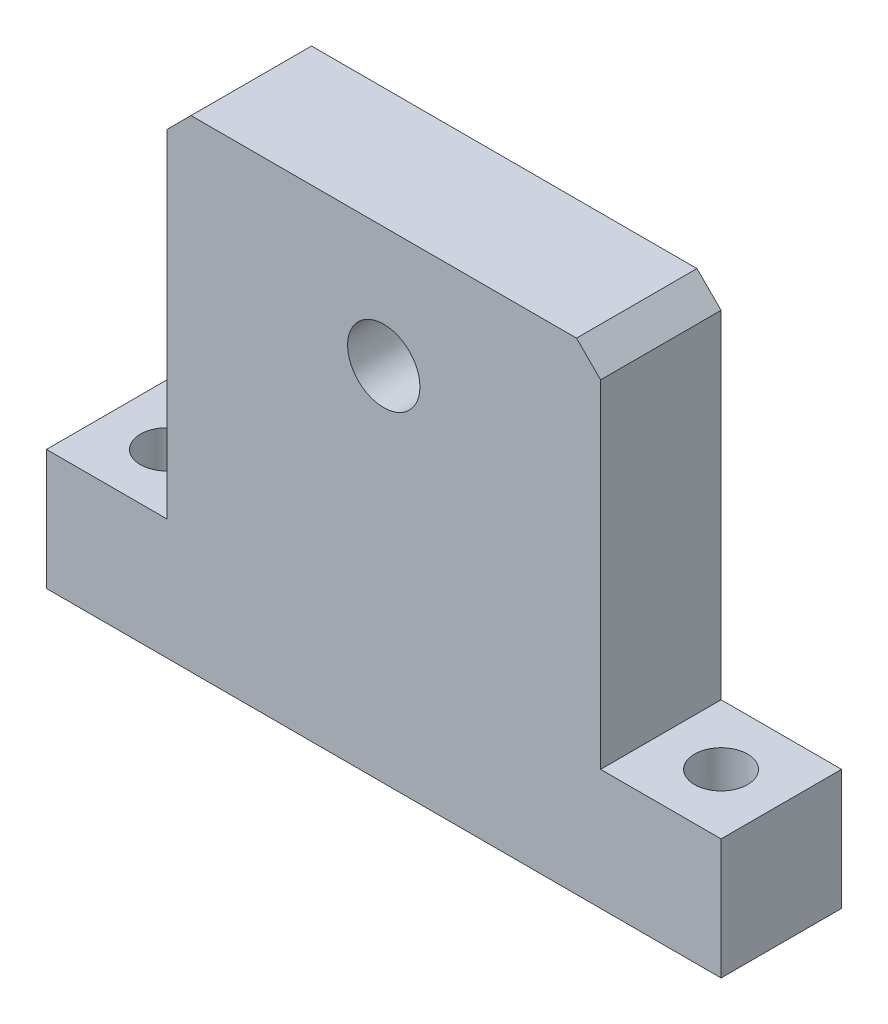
ISO-10303-21;
HEADER;
FILE_DESCRIPTION(('STEP AP214'),'2;1');
FILE_NAME('part.step','',(''),(''),'','','');
FILE_SCHEMA(('AUTOMOTIVE_DESIGN { 1 0 10303 214 1 1 1 1 }'));
ENDSEC;
DATA;
#1=APPLICATION_CONTEXT('core data for automotive mechanical design processes');
#2=APPLICATION_PROTOCOL_DEFINITION('international standard','automotive_design',2000,#1);
#3=PRODUCT_CONTEXT('',#1,'mechanical');
#4=PRODUCT('Part','Part','',(#3));
#5=PRODUCT_RELATED_PRODUCT_CATEGORY('part','',(#4));
#6=PRODUCT_DEFINITION_FORMATION('','',#4);
#7=PRODUCT_DEFINITION_CONTEXT('part definition',#1,'design');
#8=PRODUCT_DEFINITION('design','',#6,#7);
#9=PRODUCT_DEFINITION_SHAPE('','',#8);
#10=(LENGTH_UNIT() NAMED_UNIT(*) SI_UNIT(.MILLI.,.METRE.));
#11=(NAMED_UNIT(*) PLANE_ANGLE_UNIT() SI_UNIT($,.RADIAN.));
#12=(NAMED_UNIT(*) SI_UNIT($,.STERADIAN.) SOLID_ANGLE_UNIT());
#13=UNCERTAINTY_MEASURE_WITH_UNIT(LENGTH_MEASURE(1.E-05),#10,'distance_accuracy_value','');
#14=(GEOMETRIC_REPRESENTATION_CONTEXT(3) GLOBAL_UNCERTAINTY_ASSIGNED_CONTEXT((#13)) GLOBAL_UNIT_ASSIGNED_CONTEXT((#10,
#11,#12)) REPRESENTATION_CONTEXT('',''));
#15=CARTESIAN_POINT('',(0.,0.,0.));
#16=DIRECTION('',(0.,0.,1.));
#17=DIRECTION('',(1.,0.,0.));
#18=AXIS2_PLACEMENT_3D('',#15,#16,#17);
#19=CARTESIAN_POINT('',(-70.,100.,12.5));
#20=DIRECTION('',(1.,0.,0.));
#21=DIRECTION('',(0.,1.,0.));
#22=AXIS2_PLACEMENT_3D('',#19,#20,#21);
#23=PLANE('',#22);
#24=DIRECTION('',(0.,-1.,0.));
#25=VECTOR('',#24,1.);
#26=CARTESIAN_POINT('',(-70.,100.,12.5));
#27=LINE('',#26,#25);
#28=CARTESIAN_POINT('',(-70.,25.,12.5));
#29=VERTEX_POINT('',#28);
#30=CARTESIAN_POINT('',(-70.,0.,12.5));
#31=VERTEX_POINT('',#30);
#32=EDGE_CURVE('E139',#29,#31,#27,.T.);
#33=ORIENTED_EDGE('',*,*,#32,.F.);
#34=DIRECTION('',(0.,0.,1.));
#35=VECTOR('',#34,1.);
#36=CARTESIAN_POINT('',(-70.,25.,-12.5));
#37=LINE('',#36,#35);
#38=CARTESIAN_POINT('',(-70.,25.,-12.5));
#39=VERTEX_POINT('',#38);
#40=EDGE_CURVE('E195',#39,#29,#37,.T.);
#41=ORIENTED_EDGE('',*,*,#40,.F.);
#42=DIRECTION('',(0.,-1.,0.));
#43=VECTOR('',#42,1.);
#44=CARTESIAN_POINT('',(-70.,100.,-12.5));
#45=LINE('',#44,#43);
#46=CARTESIAN_POINT('',(-70.,0.,-12.5));
#47=VERTEX_POINT('',#46);
#48=EDGE_CURVE('E141',#39,#47,#45,.T.);
#49=ORIENTED_EDGE('',*,*,#48,.T.);
#50=DIRECTION('',(0.,0.,-1.));
#51=VECTOR('',#50,1.);
#52=CARTESIAN_POINT('',(-70.,0.,12.5));
#53=LINE('',#52,#51);
#54=EDGE_CURVE('E146',#31,#47,#53,.T.);
#55=ORIENTED_EDGE('',*,*,#54,.F.);
#56=EDGE_LOOP('',(#33,#41,#49,#55));
#57=FACE_BOUND('',#56,.T.);
#58=ADVANCED_FACE('F30',(#57),#23,.F.);
#59=CARTESIAN_POINT('',(-70.,0.,12.5));
#60=DIRECTION('',(0.,1.,0.));
#61=DIRECTION('',(0.,0.,1.));
#62=AXIS2_PLACEMENT_3D('',#59,#60,#61);
#63=PLANE('',#62);
#64=CARTESIAN_POINT('',(-57.5,0.,0.));
#65=DIRECTION('',(0.,1.,0.));
#66=DIRECTION('',(0.,0.,1.));
#67=AXIS2_PLACEMENT_3D('',#64,#65,#66);
#68=CIRCLE('',#67,5.5);
#69=CARTESIAN_POINT('',(-57.5,0.,5.5));
#70=VERTEX_POINT('',#69);
#71=EDGE_CURVE('E154',#70,#70,#68,.T.);
#72=ORIENTED_EDGE('',*,*,#71,.T.);
#73=EDGE_LOOP('',(#72));
#74=FACE_BOUND('',#73,.T.);
#75=CARTESIAN_POINT('',(57.5,0.,0.));
#76=DIRECTION('',(0.,1.,0.));
#77=DIRECTION('',(0.,0.,1.));
#78=AXIS2_PLACEMENT_3D('',#75,#76,#77);
#79=CIRCLE('',#78,5.5);
#80=CARTESIAN_POINT('',(57.5,0.,5.5));
#81=VERTEX_POINT('',#80);
#82=EDGE_CURVE('E199',#81,#81,#79,.T.);
#83=ORIENTED_EDGE('',*,*,#82,.T.);
#84=EDGE_LOOP('',(#83));
#85=FACE_BOUND('',#84,.T.);
#86=DIRECTION('',(1.,0.,0.));
#87=VECTOR('',#86,1.);
#88=CARTESIAN_POINT('',(-70.,0.,-12.5));
#89=LINE('',#88,#87);
#90=CARTESIAN_POINT('',(70.,0.,-12.5));
#91=VERTEX_POINT('',#90);
#92=EDGE_CURVE('E136',#47,#91,#89,.T.);
#93=ORIENTED_EDGE('',*,*,#92,.T.);
#94=DIRECTION('',(0.,0.,-1.));
#95=VECTOR('',#94,1.);
#96=CARTESIAN_POINT('',(70.,0.,12.5));
#97=LINE('',#96,#95);
#98=CARTESIAN_POINT('',(70.,0.,12.5));
#99=VERTEX_POINT('',#98);
#100=EDGE_CURVE('E134',#99,#91,#97,.T.);
#101=ORIENTED_EDGE('',*,*,#100,.F.);
#102=DIRECTION('',(1.,0.,0.));
#103=VECTOR('',#102,1.);
#104=CARTESIAN_POINT('',(-70.,0.,12.5));
#105=LINE('',#104,#103);
#106=EDGE_CURVE('E209',#31,#99,#105,.T.);
#107=ORIENTED_EDGE('',*,*,#106,.F.);
#108=ORIENTED_EDGE('',*,*,#54,.T.);
#109=EDGE_LOOP('',(#93,#101,#107,#108));
#110=FACE_BOUND('',#109,.T.);
#111=ADVANCED_FACE('F220',(#74,#85,#110),#63,.F.);
#112=CARTESIAN_POINT('',(70.,100.,12.5));
#113=DIRECTION('',(-1.,0.,0.));
#114=DIRECTION('',(0.,-1.,0.));
#115=AXIS2_PLACEMENT_3D('',#112,#113,#114);
#116=PLANE('',#115);
#117=DIRECTION('',(0.,1.,0.));
#118=VECTOR('',#117,1.);
#119=CARTESIAN_POINT('',(70.,100.,-12.5));
#120=LINE('',#119,#118);
#121=CARTESIAN_POINT('',(70.,25.,-12.5));
#122=VERTEX_POINT('',#121);
#123=EDGE_CURVE('E128',#91,#122,#120,.T.);
#124=ORIENTED_EDGE('',*,*,#123,.T.);
#125=DIRECTION('',(0.,0.,1.));
#126=VECTOR('',#125,1.);
#127=CARTESIAN_POINT('',(70.,25.,-12.5));
#128=LINE('',#127,#126);
#129=CARTESIAN_POINT('',(70.,25.,12.5));
#130=VERTEX_POINT('',#129);
#131=EDGE_CURVE('E109',#122,#130,#128,.T.);
#132=ORIENTED_EDGE('',*,*,#131,.T.);
#133=DIRECTION('',(0.,1.,0.));
#134=VECTOR('',#133,1.);
#135=CARTESIAN_POINT('',(70.,100.,12.5));
#136=LINE('',#135,#134);
#137=EDGE_CURVE('E211',#99,#130,#136,.T.);
#138=ORIENTED_EDGE('',*,*,#137,.F.);
#139=ORIENTED_EDGE('',*,*,#100,.T.);
#140=EDGE_LOOP('',(#124,#132,#138,#139));
#141=FACE_BOUND('',#140,.T.);
#142=ADVANCED_FACE('F132',(#141),#116,.F.);
#143=CARTESIAN_POINT('',(-70.,100.,12.5));
#144=DIRECTION('',(0.,-1.,0.));
#145=DIRECTION('',(0.,0.,-1.));
#146=AXIS2_PLACEMENT_3D('',#143,#144,#145);
#147=PLANE('',#146);
#148=DIRECTION('',(-1.,0.,0.));
#149=VECTOR('',#148,1.);
#150=CARTESIAN_POINT('',(-70.,100.,-12.5));
#151=LINE('',#150,#149);
#152=CARTESIAN_POINT('',(40.,100.,-12.5));
#153=VERTEX_POINT('',#152);
#154=CARTESIAN_POINT('',(-40.,100.,-12.5));
#155=VERTEX_POINT('',#154);
#156=EDGE_CURVE('E135',#153,#155,#151,.T.);
#157=ORIENTED_EDGE('',*,*,#156,.T.);
#158=DIRECTION('',(0.,0.,1.));
#159=VECTOR('',#158,1.);
#160=CARTESIAN_POINT('',(-40.,100.,12.5));
#161=LINE('',#160,#159);
#162=CARTESIAN_POINT('',(-40.,100.,12.5));
#163=VERTEX_POINT('',#162);
#164=EDGE_CURVE('E160',#155,#163,#161,.T.);
#165=ORIENTED_EDGE('',*,*,#164,.T.);
#166=DIRECTION('',(-1.,0.,0.));
#167=VECTOR('',#166,1.);
#168=CARTESIAN_POINT('',(-70.,100.,12.5));
#169=LINE('',#168,#167);
#170=CARTESIAN_POINT('',(40.,100.,12.5));
#171=VERTEX_POINT('',#170);
#172=EDGE_CURVE('E147',#171,#163,#169,.T.);
#173=ORIENTED_EDGE('',*,*,#172,.F.);
#174=DIRECTION('',(0.,0.,-1.));
#175=VECTOR('',#174,1.);
#176=CARTESIAN_POINT('',(40.,100.,12.5));
#177=LINE('',#176,#175);
#178=EDGE_CURVE('E150',#171,#153,#177,.T.);
#179=ORIENTED_EDGE('',*,*,#178,.T.);
#180=EDGE_LOOP('',(#157,#165,#173,#179));
#181=FACE_BOUND('',#180,.T.);
#182=ADVANCED_FACE('F174',(#181),#147,.F.);
#183=CARTESIAN_POINT('',(-70.,0.,12.5));
#184=DIRECTION('',(0.,0.,1.));
#185=DIRECTION('',(1.,0.,0.));
#186=AXIS2_PLACEMENT_3D('',#183,#184,#185);
#187=PLANE('',#186);
#188=ORIENTED_EDGE('',*,*,#172,.T.);
#189=DIRECTION('',(0.707106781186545,0.70710678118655,0.));
#190=VECTOR('',#189,1.);
#191=CARTESIAN_POINT('',(-105.,34.9999999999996,12.5));
#192=LINE('',#191,#190);
#193=CARTESIAN_POINT('',(-45.,94.9999999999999,12.5));
#194=VERTEX_POINT('',#193);
#195=EDGE_CURVE('E165',#163,#194,#192,.F.);
#196=ORIENTED_EDGE('',*,*,#195,.T.);
#197=DIRECTION('',(0.,1.,0.));
#198=VECTOR('',#197,1.);
#199=CARTESIAN_POINT('',(-45.,100.,12.5));
#200=LINE('',#199,#198);
#201=CARTESIAN_POINT('',(-45.,25.,12.5));
#202=VERTEX_POINT('',#201);
#203=EDGE_CURVE('E184',#202,#194,#200,.T.);
#204=ORIENTED_EDGE('',*,*,#203,.F.);
#205=DIRECTION('',(1.,0.,0.));
#206=VECTOR('',#205,1.);
#207=CARTESIAN_POINT('',(-70.,25.,12.5));
#208=LINE('',#207,#206);
#209=EDGE_CURVE('E158',#29,#202,#208,.T.);
#210=ORIENTED_EDGE('',*,*,#209,.F.);
#211=ORIENTED_EDGE('',*,*,#32,.T.);
#212=ORIENTED_EDGE('',*,*,#106,.T.);
#213=ORIENTED_EDGE('',*,*,#137,.T.);
#214=DIRECTION('',(1.,0.,0.));
#215=VECTOR('',#214,1.);
#216=CARTESIAN_POINT('',(70.,25.,12.5));
#217=LINE('',#216,#215);
#218=CARTESIAN_POINT('',(45.,25.,12.5));
#219=VERTEX_POINT('',#218);
#220=EDGE_CURVE('E117',#219,#130,#217,.T.);
#221=ORIENTED_EDGE('',*,*,#220,.F.);
#222=DIRECTION('',(0.,-1.,0.));
#223=VECTOR('',#222,1.);
#224=CARTESIAN_POINT('',(45.,100.,12.5));
#225=LINE('',#224,#223);
#226=CARTESIAN_POINT('',(45.,95.,12.5));
#227=VERTEX_POINT('',#226);
#228=EDGE_CURVE('E365',#227,#219,#225,.T.);
#229=ORIENTED_EDGE('',*,*,#228,.F.);
#230=DIRECTION('',(0.707106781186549,-0.707106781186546,0.));
#231=VECTOR('',#230,1.);
#232=CARTESIAN_POINT('',(34.9999999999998,105.,12.5));
#233=LINE('',#232,#231);
#234=EDGE_CURVE('E163',#227,#171,#233,.F.);
#235=ORIENTED_EDGE('',*,*,#234,.T.);
#236=EDGE_LOOP('',(#188,#196,#204,#210,#211,#212,#213,#221,#229,#235));
#237=FACE_BOUND('',#236,.T.);
#238=CARTESIAN_POINT('',(0.,75.,12.5));
#239=DIRECTION('',(0.,0.,1.));
#240=DIRECTION('',(1.,0.,0.));
#241=AXIS2_PLACEMENT_3D('',#238,#239,#240);
#242=CIRCLE('',#241,7.5);
#243=CARTESIAN_POINT('',(7.5,75.,12.5));
#244=VERTEX_POINT('',#243);
#245=EDGE_CURVE('E202',#244,#244,#242,.T.);
#246=ORIENTED_EDGE('',*,*,#245,.F.);
#247=EDGE_LOOP('',(#246));
#248=FACE_BOUND('',#247,.T.);
#249=ADVANCED_FACE('F181',(#237,#248),#187,.T.);
#250=CARTESIAN_POINT('',(-70.,0.,-12.5));
#251=DIRECTION('',(0.,0.,1.));
#252=DIRECTION('',(1.,0.,0.));
#253=AXIS2_PLACEMENT_3D('',#250,#251,#252);
#254=PLANE('',#253);
#255=CARTESIAN_POINT('',(0.,75.,-12.5));
#256=DIRECTION('',(0.,0.,1.));
#257=DIRECTION('',(1.,0.,0.));
#258=AXIS2_PLACEMENT_3D('',#255,#256,#257);
#259=CIRCLE('',#258,7.5);
#260=CARTESIAN_POINT('',(7.5,75.,-12.5));
#261=VERTEX_POINT('',#260);
#262=EDGE_CURVE('E203',#261,#261,#259,.T.);
#263=ORIENTED_EDGE('',*,*,#262,.T.);
#264=EDGE_LOOP('',(#263));
#265=FACE_BOUND('',#264,.T.);
#266=DIRECTION('',(0.,1.,0.));
#267=VECTOR('',#266,1.);
#268=CARTESIAN_POINT('',(-45.,100.,-12.5));
#269=LINE('',#268,#267);
#270=CARTESIAN_POINT('',(-45.,25.,-12.5));
#271=VERTEX_POINT('',#270);
#272=CARTESIAN_POINT('',(-45.,94.9999999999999,-12.5));
#273=VERTEX_POINT('',#272);
#274=EDGE_CURVE('E170',#271,#273,#269,.T.);
#275=ORIENTED_EDGE('',*,*,#274,.T.);
#276=DIRECTION('',(-0.707106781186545,-0.70710678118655,0.));
#277=VECTOR('',#276,1.);
#278=CARTESIAN_POINT('',(-40.,100.,-12.5));
#279=LINE('',#278,#277);
#280=EDGE_CURVE('E38',#273,#155,#279,.F.);
#281=ORIENTED_EDGE('',*,*,#280,.T.);
#282=ORIENTED_EDGE('',*,*,#156,.F.);
#283=DIRECTION('',(-0.707106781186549,0.707106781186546,0.));
#284=VECTOR('',#283,1.);
#285=CARTESIAN_POINT('',(45.,95.,-12.5));
#286=LINE('',#285,#284);
#287=CARTESIAN_POINT('',(45.,95.,-12.5));
#288=VERTEX_POINT('',#287);
#289=EDGE_CURVE('E45',#153,#288,#286,.F.);
#290=ORIENTED_EDGE('',*,*,#289,.T.);
#291=DIRECTION('',(0.,-1.,0.));
#292=VECTOR('',#291,1.);
#293=CARTESIAN_POINT('',(45.,100.,-12.5));
#294=LINE('',#293,#292);
#295=CARTESIAN_POINT('',(45.,25.,-12.5));
#296=VERTEX_POINT('',#295);
#297=EDGE_CURVE('E129',#288,#296,#294,.T.);
#298=ORIENTED_EDGE('',*,*,#297,.T.);
#299=DIRECTION('',(1.,0.,0.));
#300=VECTOR('',#299,1.);
#301=CARTESIAN_POINT('',(70.,25.,-12.5));
#302=LINE('',#301,#300);
#303=EDGE_CURVE('E114',#296,#122,#302,.T.);
#304=ORIENTED_EDGE('',*,*,#303,.T.);
#305=ORIENTED_EDGE('',*,*,#123,.F.);
#306=ORIENTED_EDGE('',*,*,#92,.F.);
#307=ORIENTED_EDGE('',*,*,#48,.F.);
#308=DIRECTION('',(1.,0.,0.));
#309=VECTOR('',#308,1.);
#310=CARTESIAN_POINT('',(-70.,25.,-12.5));
#311=LINE('',#310,#309);
#312=EDGE_CURVE('E188',#39,#271,#311,.T.);
#313=ORIENTED_EDGE('',*,*,#312,.T.);
#314=EDGE_LOOP('',(#275,#281,#282,#290,#298,#304,#305,#306,#307,#313));
#315=FACE_BOUND('',#314,.T.);
#316=ADVANCED_FACE('F126',(#265,#315),#254,.F.);
#317=CARTESIAN_POINT('',(0.,75.,-12.5));
#318=DIRECTION('',(0.,0.,1.));
#319=DIRECTION('',(1.,0.,0.));
#320=AXIS2_PLACEMENT_3D('',#317,#318,#319);
#321=CYLINDRICAL_SURFACE('',#320,7.5);
#322=ORIENTED_EDGE('',*,*,#262,.F.);
#323=EDGE_LOOP('',(#322));
#324=FACE_BOUND('',#323,.T.);
#325=ORIENTED_EDGE('',*,*,#245,.T.);
#326=EDGE_LOOP('',(#325));
#327=FACE_BOUND('',#326,.T.);
#328=ADVANCED_FACE('F241',(#324,#327),#321,.F.);
#329=CARTESIAN_POINT('',(57.5,0.,0.));
#330=DIRECTION('',(0.,1.,0.));
#331=DIRECTION('',(0.,0.,1.));
#332=AXIS2_PLACEMENT_3D('',#329,#330,#331);
#333=CYLINDRICAL_SURFACE('',#332,5.5);
#334=CARTESIAN_POINT('',(57.5,25.,0.));
#335=DIRECTION('',(0.,-1.,0.));
#336=DIRECTION('',(0.,0.,-1.));
#337=AXIS2_PLACEMENT_3D('',#334,#335,#336);
#338=CIRCLE('',#337,5.5);
#339=CARTESIAN_POINT('',(57.5,25.,-5.5));
#340=VERTEX_POINT('',#339);
#341=EDGE_CURVE('E122',#340,#340,#338,.F.);
#342=ORIENTED_EDGE('',*,*,#341,.T.);
#343=EDGE_LOOP('',(#342));
#344=FACE_BOUND('',#343,.T.);
#345=ORIENTED_EDGE('',*,*,#82,.F.);
#346=EDGE_LOOP('',(#345));
#347=FACE_BOUND('',#346,.T.);
#348=ADVANCED_FACE('F231',(#344,#347),#333,.F.);
#349=CARTESIAN_POINT('',(-57.5,0.,0.));
#350=DIRECTION('',(0.,1.,0.));
#351=DIRECTION('',(0.,0.,1.));
#352=AXIS2_PLACEMENT_3D('',#349,#350,#351);
#353=CYLINDRICAL_SURFACE('',#352,5.5);
#354=CARTESIAN_POINT('',(-57.5,25.,0.));
#355=DIRECTION('',(0.,-1.,0.));
#356=DIRECTION('',(0.,0.,-1.));
#357=AXIS2_PLACEMENT_3D('',#354,#355,#356);
#358=CIRCLE('',#357,5.5);
#359=CARTESIAN_POINT('',(-57.5,25.,-5.5));
#360=VERTEX_POINT('',#359);
#361=EDGE_CURVE('E151',#360,#360,#358,.F.);
#362=ORIENTED_EDGE('',*,*,#361,.T.);
#363=EDGE_LOOP('',(#362));
#364=FACE_BOUND('',#363,.T.);
#365=ORIENTED_EDGE('',*,*,#71,.F.);
#366=EDGE_LOOP('',(#365));
#367=FACE_BOUND('',#366,.T.);
#368=ADVANCED_FACE('F225',(#364,#367),#353,.F.);
#369=CARTESIAN_POINT('',(-70.,25.,-12.5));
#370=DIRECTION('',(0.,-1.,0.));
#371=DIRECTION('',(0.,0.,-1.));
#372=AXIS2_PLACEMENT_3D('',#369,#370,#371);
#373=PLANE('',#372);
#374=ORIENTED_EDGE('',*,*,#209,.T.);
#375=DIRECTION('',(0.,0.,1.));
#376=VECTOR('',#375,1.);
#377=CARTESIAN_POINT('',(-45.,25.,-12.5));
#378=LINE('',#377,#376);
#379=EDGE_CURVE('E155',#271,#202,#378,.T.);
#380=ORIENTED_EDGE('',*,*,#379,.F.);
#381=ORIENTED_EDGE('',*,*,#312,.F.);
#382=ORIENTED_EDGE('',*,*,#40,.T.);
#383=EDGE_LOOP('',(#374,#380,#381,#382));
#384=FACE_BOUND('',#383,.T.);
#385=ORIENTED_EDGE('',*,*,#361,.F.);
#386=EDGE_LOOP('',(#385));
#387=FACE_BOUND('',#386,.T.);
#388=ADVANCED_FACE('F222',(#384,#387),#373,.F.);
#389=CARTESIAN_POINT('',(-45.,100.,-12.5));
#390=DIRECTION('',(1.,0.,0.));
#391=DIRECTION('',(0.,1.,0.));
#392=AXIS2_PLACEMENT_3D('',#389,#390,#391);
#393=PLANE('',#392);
#394=ORIENTED_EDGE('',*,*,#203,.T.);
#395=DIRECTION('',(0.,0.,-1.));
#396=VECTOR('',#395,1.);
#397=CARTESIAN_POINT('',(-45.,94.9999999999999,-12.5));
#398=LINE('',#397,#396);
#399=EDGE_CURVE('E53',#194,#273,#398,.T.);
#400=ORIENTED_EDGE('',*,*,#399,.T.);
#401=ORIENTED_EDGE('',*,*,#274,.F.);
#402=ORIENTED_EDGE('',*,*,#379,.T.);
#403=EDGE_LOOP('',(#394,#400,#401,#402));
#404=FACE_BOUND('',#403,.T.);
#405=ADVANCED_FACE('F185',(#404),#393,.F.);
#406=CARTESIAN_POINT('',(70.,25.,-12.5));
#407=DIRECTION('',(0.,-1.,0.));
#408=DIRECTION('',(0.,0.,-1.));
#409=AXIS2_PLACEMENT_3D('',#406,#407,#408);
#410=PLANE('',#409);
#411=ORIENTED_EDGE('',*,*,#220,.T.);
#412=ORIENTED_EDGE('',*,*,#131,.F.);
#413=ORIENTED_EDGE('',*,*,#303,.F.);
#414=DIRECTION('',(0.,0.,1.));
#415=VECTOR('',#414,1.);
#416=CARTESIAN_POINT('',(45.,25.,-12.5));
#417=LINE('',#416,#415);
#418=EDGE_CURVE('E123',#296,#219,#417,.T.);
#419=ORIENTED_EDGE('',*,*,#418,.T.);
#420=EDGE_LOOP('',(#411,#412,#413,#419));
#421=FACE_BOUND('',#420,.T.);
#422=ORIENTED_EDGE('',*,*,#341,.F.);
#423=EDGE_LOOP('',(#422));
#424=FACE_BOUND('',#423,.T.);
#425=ADVANCED_FACE('F111',(#421,#424),#410,.F.);
#426=CARTESIAN_POINT('',(45.,100.,-12.5));
#427=DIRECTION('',(-1.,0.,0.));
#428=DIRECTION('',(0.,-1.,0.));
#429=AXIS2_PLACEMENT_3D('',#426,#427,#428);
#430=PLANE('',#429);
#431=ORIENTED_EDGE('',*,*,#297,.F.);
#432=DIRECTION('',(0.,0.,1.));
#433=VECTOR('',#432,1.);
#434=CARTESIAN_POINT('',(45.,95.,-12.5));
#435=LINE('',#434,#433);
#436=EDGE_CURVE('E11',#288,#227,#435,.T.);
#437=ORIENTED_EDGE('',*,*,#436,.T.);
#438=ORIENTED_EDGE('',*,*,#228,.T.);
#439=ORIENTED_EDGE('',*,*,#418,.F.);
#440=EDGE_LOOP('',(#431,#437,#438,#439));
#441=FACE_BOUND('',#440,.T.);
#442=ADVANCED_FACE('F255',(#441),#430,.F.);
#443=CARTESIAN_POINT('',(-40.,100.,12.5));
#444=DIRECTION('',(0.70710678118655,-0.707106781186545,0.));
#445=DIRECTION('',(0.707106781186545,0.70710678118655,0.));
#446=AXIS2_PLACEMENT_3D('',#443,#444,#445);
#447=PLANE('',#446);
#448=ORIENTED_EDGE('',*,*,#280,.F.);
#449=ORIENTED_EDGE('',*,*,#399,.F.);
#450=ORIENTED_EDGE('',*,*,#195,.F.);
#451=ORIENTED_EDGE('',*,*,#164,.F.);
#452=EDGE_LOOP('',(#448,#449,#450,#451));
#453=FACE_BOUND('',#452,.T.);
#454=ADVANCED_FACE('F178',(#453),#447,.F.);
#455=CARTESIAN_POINT('',(45.,95.,-12.5));
#456=DIRECTION('',(-0.707106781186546,-0.707106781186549,0.));
#457=DIRECTION('',(0.707106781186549,-0.707106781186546,0.));
#458=AXIS2_PLACEMENT_3D('',#455,#456,#457);
#459=PLANE('',#458);
#460=ORIENTED_EDGE('',*,*,#289,.F.);
#461=ORIENTED_EDGE('',*,*,#178,.F.);
#462=ORIENTED_EDGE('',*,*,#234,.F.);
#463=ORIENTED_EDGE('',*,*,#436,.F.);
#464=EDGE_LOOP('',(#460,#461,#462,#463));
#465=FACE_BOUND('',#464,.T.);
#466=ADVANCED_FACE('F32',(#465),#459,.F.);
#467=CLOSED_SHELL('',(#58,#111,#142,#182,#249,#316,#328,#348,#368,#388,#405,#425,#442,#454,#466));
#468=MANIFOLD_SOLID_BREP('B2',#467);
#469=ADVANCED_BREP_SHAPE_REPRESENTATION('',(#18,#468),#14);
#470=SHAPE_DEFINITION_REPRESENTATION(#9,#469);
ENDSEC;
END-ISO-10303-21;
